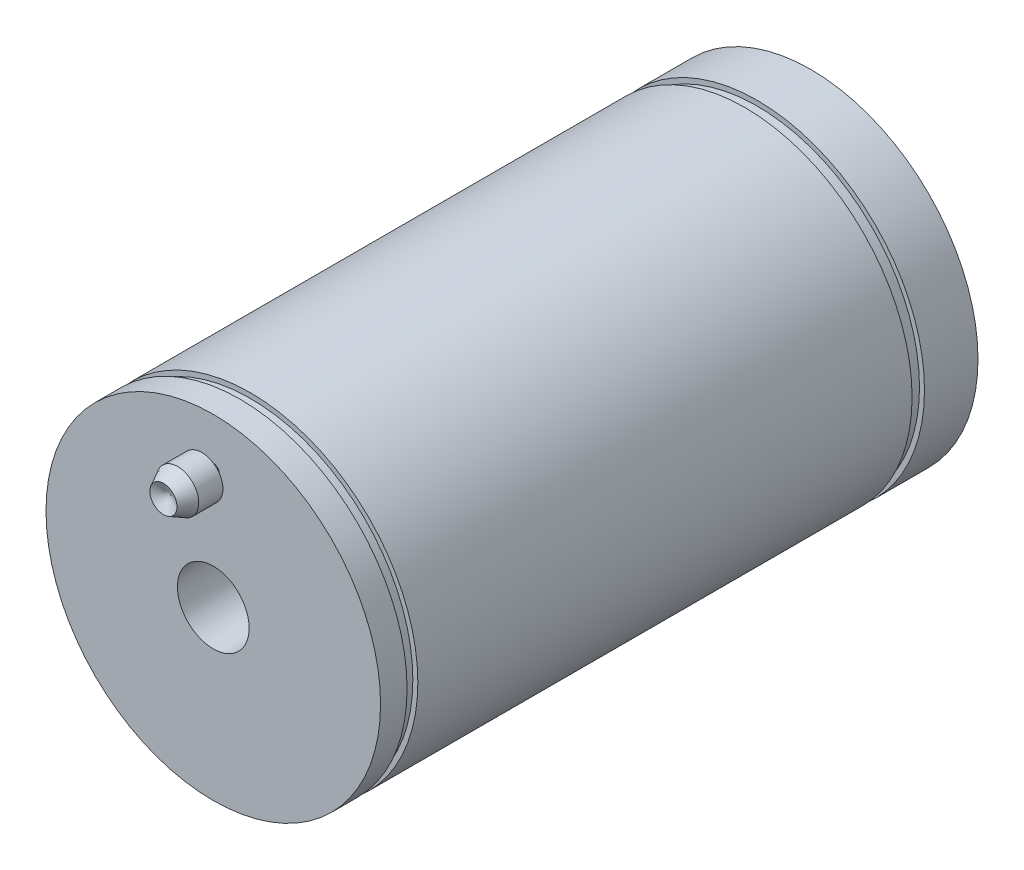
ISO-10303-21;
HEADER;
FILE_DESCRIPTION(('STEP AP214'),'2;1');
FILE_NAME('part.step','',(''),(''),'','','');
FILE_SCHEMA(('AUTOMOTIVE_DESIGN { 1 0 10303 214 1 1 1 1 }'));
ENDSEC;
DATA;
#1=APPLICATION_CONTEXT('core data for automotive mechanical design processes');
#2=APPLICATION_PROTOCOL_DEFINITION('international standard','automotive_design',2000,#1);
#3=PRODUCT_CONTEXT('',#1,'mechanical');
#4=PRODUCT('Part','Part','',(#3));
#5=PRODUCT_RELATED_PRODUCT_CATEGORY('part','',(#4));
#6=PRODUCT_DEFINITION_FORMATION('','',#4);
#7=PRODUCT_DEFINITION_CONTEXT('part definition',#1,'design');
#8=PRODUCT_DEFINITION('design','',#6,#7);
#9=PRODUCT_DEFINITION_SHAPE('','',#8);
#10=(LENGTH_UNIT() NAMED_UNIT(*) SI_UNIT(.MILLI.,.METRE.));
#11=(NAMED_UNIT(*) PLANE_ANGLE_UNIT() SI_UNIT($,.RADIAN.));
#12=(NAMED_UNIT(*) SI_UNIT($,.STERADIAN.) SOLID_ANGLE_UNIT());
#13=UNCERTAINTY_MEASURE_WITH_UNIT(LENGTH_MEASURE(1.E-05),#10,'distance_accuracy_value','');
#14=(GEOMETRIC_REPRESENTATION_CONTEXT(3) GLOBAL_UNCERTAINTY_ASSIGNED_CONTEXT((#13)) GLOBAL_UNIT_ASSIGNED_CONTEXT((#10,
#11,#12)) REPRESENTATION_CONTEXT('',''));
#15=CARTESIAN_POINT('',(0.,0.,0.));
#16=DIRECTION('',(0.,0.,1.));
#17=DIRECTION('',(1.,0.,0.));
#18=AXIS2_PLACEMENT_3D('',#15,#16,#17);
#19=CARTESIAN_POINT('',(0.,0.,-250.));
#20=DIRECTION('',(0.,0.,1.));
#21=DIRECTION('',(1.,0.,0.));
#22=AXIS2_PLACEMENT_3D('',#19,#20,#21);
#23=CYLINDRICAL_SURFACE('',#22,70.);
#24=CARTESIAN_POINT('',(0.,0.,0.));
#25=DIRECTION('',(0.,0.,1.));
#26=DIRECTION('',(1.,0.,0.));
#27=AXIS2_PLACEMENT_3D('',#24,#25,#26);
#28=CIRCLE('',#27,70.);
#29=CARTESIAN_POINT('',(70.,0.,0.));
#30=VERTEX_POINT('',#29);
#31=EDGE_CURVE('E44',#30,#30,#28,.T.);
#32=ORIENTED_EDGE('',*,*,#31,.F.);
#33=EDGE_LOOP('',(#32));
#34=FACE_BOUND('',#33,.T.);
#35=CARTESIAN_POINT('',(0.,0.,-11.0892700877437));
#36=DIRECTION('',(0.,0.,-1.));
#37=DIRECTION('',(-1.,0.,0.));
#38=AXIS2_PLACEMENT_3D('',#35,#36,#37);
#39=CIRCLE('',#38,70.);
#40=CARTESIAN_POINT('',(-70.,0.,-11.0892700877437));
#41=VERTEX_POINT('',#40);
#42=EDGE_CURVE('E90',#41,#41,#39,.F.);
#43=ORIENTED_EDGE('',*,*,#42,.T.);
#44=EDGE_LOOP('',(#43));
#45=FACE_BOUND('',#44,.T.);
#46=ADVANCED_FACE('F37',(#34,#45),#23,.T.);
#47=CARTESIAN_POINT('',(0.,0.,0.));
#48=DIRECTION('',(0.,0.,1.));
#49=DIRECTION('',(1.,0.,0.));
#50=AXIS2_PLACEMENT_3D('',#47,#48,#49);
#51=PLANE('',#50);
#52=CARTESIAN_POINT('',(0.,0.,0.));
#53=DIRECTION('',(0.,0.,1.));
#54=DIRECTION('',(1.,0.,0.));
#55=AXIS2_PLACEMENT_3D('',#52,#53,#54);
#56=CIRCLE('',#55,15.);
#57=CARTESIAN_POINT('',(15.,0.,0.));
#58=VERTEX_POINT('',#57);
#59=EDGE_CURVE('E59',#58,#58,#56,.T.);
#60=ORIENTED_EDGE('',*,*,#59,.F.);
#61=EDGE_LOOP('',(#60));
#62=FACE_BOUND('',#61,.T.);
#63=CARTESIAN_POINT('',(0.,49.7478647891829,0.));
#64=DIRECTION('',(0.,0.,1.));
#65=DIRECTION('',(1.,0.,0.));
#66=AXIS2_PLACEMENT_3D('',#63,#64,#65);
#67=CIRCLE('',#66,2.54698851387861);
#68=CARTESIAN_POINT('',(2.54698851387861,49.7478647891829,0.));
#69=VERTEX_POINT('',#68);
#70=EDGE_CURVE('E72',#69,#69,#67,.T.);
#71=ORIENTED_EDGE('',*,*,#70,.F.);
#72=EDGE_LOOP('',(#71));
#73=FACE_BOUND('',#72,.T.);
#74=ORIENTED_EDGE('',*,*,#31,.T.);
#75=EDGE_LOOP('',(#74));
#76=FACE_BOUND('',#75,.T.);
#77=ADVANCED_FACE('F106',(#62,#73,#76),#51,.T.);
#78=CARTESIAN_POINT('',(0.,71.4110782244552,-11.0892700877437));
#79=DIRECTION('',(0.,0.,-1.));
#80=DIRECTION('',(-1.,0.,0.));
#81=AXIS2_PLACEMENT_3D('',#78,#79,#80);
#82=PLANE('',#81);
#83=ORIENTED_EDGE('',*,*,#42,.F.);
#84=EDGE_LOOP('',(#83));
#85=FACE_BOUND('',#84,.T.);
#86=CARTESIAN_POINT('',(0.,0.,-11.0892700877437));
#87=DIRECTION('',(0.,0.,1.));
#88=DIRECTION('',(1.,0.,0.));
#89=AXIS2_PLACEMENT_3D('',#86,#87,#88);
#90=CIRCLE('',#89,67.9131744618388);
#91=CARTESIAN_POINT('',(67.9131744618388,0.,-11.0892700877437));
#92=VERTEX_POINT('',#91);
#93=EDGE_CURVE('E79',#92,#92,#90,.T.);
#94=ORIENTED_EDGE('',*,*,#93,.T.);
#95=EDGE_LOOP('',(#94));
#96=FACE_BOUND('',#95,.T.);
#97=ADVANCED_FACE('F102',(#85,#96),#82,.T.);
#98=CARTESIAN_POINT('',(0.,0.,46.5475958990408));
#99=DIRECTION('',(0.,0.,1.));
#100=DIRECTION('',(1.,0.,0.));
#101=AXIS2_PLACEMENT_3D('',#98,#99,#100);
#102=CYLINDRICAL_SURFACE('',#101,67.9131744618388);
#103=CARTESIAN_POINT('',(0.,0.,-15.5976793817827));
#104=DIRECTION('',(0.,0.,1.));
#105=DIRECTION('',(1.,0.,0.));
#106=AXIS2_PLACEMENT_3D('',#103,#104,#105);
#107=CIRCLE('',#106,67.9131744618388);
#108=CARTESIAN_POINT('',(67.9131744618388,0.,-15.5976793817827));
#109=VERTEX_POINT('',#108);
#110=EDGE_CURVE('E76',#109,#109,#107,.T.);
#111=ORIENTED_EDGE('',*,*,#110,.T.);
#112=EDGE_LOOP('',(#111));
#113=FACE_BOUND('',#112,.T.);
#114=ORIENTED_EDGE('',*,*,#93,.F.);
#115=EDGE_LOOP('',(#114));
#116=FACE_BOUND('',#115,.T.);
#117=ADVANCED_FACE('F105',(#113,#116),#102,.T.);
#118=CARTESIAN_POINT('',(0.,71.4110782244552,-15.5976793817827));
#119=DIRECTION('',(0.,0.,1.));
#120=DIRECTION('',(1.,0.,0.));
#121=AXIS2_PLACEMENT_3D('',#118,#119,#120);
#122=PLANE('',#121);
#123=CARTESIAN_POINT('',(0.,0.,-15.5976793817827));
#124=DIRECTION('',(0.,0.,1.));
#125=DIRECTION('',(1.,0.,0.));
#126=AXIS2_PLACEMENT_3D('',#123,#124,#125);
#127=CIRCLE('',#126,70.);
#128=CARTESIAN_POINT('',(70.,0.,-15.5976793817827));
#129=VERTEX_POINT('',#128);
#130=EDGE_CURVE('E96',#129,#129,#127,.F.);
#131=ORIENTED_EDGE('',*,*,#130,.F.);
#132=EDGE_LOOP('',(#131));
#133=FACE_BOUND('',#132,.T.);
#134=ORIENTED_EDGE('',*,*,#110,.F.);
#135=EDGE_LOOP('',(#134));
#136=FACE_BOUND('',#135,.T.);
#137=ADVANCED_FACE('F111',(#133,#136),#122,.T.);
#138=CARTESIAN_POINT('',(0.,0.,-222.422131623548));
#139=DIRECTION('',(0.,0.,-1.));
#140=DIRECTION('',(-1.,0.,0.));
#141=AXIS2_PLACEMENT_3D('',#138,#139,#140);
#142=CIRCLE('',#141,70.);
#143=CARTESIAN_POINT('',(-70.,0.,-222.422131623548));
#144=VERTEX_POINT('',#143);
#145=EDGE_CURVE('E93',#144,#144,#142,.F.);
#146=ORIENTED_EDGE('',*,*,#145,.T.);
#147=EDGE_LOOP('',(#146));
#148=FACE_BOUND('',#147,.T.);
#149=ORIENTED_EDGE('',*,*,#130,.T.);
#150=EDGE_LOOP('',(#149));
#151=FACE_BOUND('',#150,.T.);
#152=ADVANCED_FACE('F117',(#148,#151),#23,.T.);
#153=CARTESIAN_POINT('',(0.,71.4110782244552,-222.422131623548));
#154=DIRECTION('',(0.,0.,-1.));
#155=DIRECTION('',(-1.,0.,0.));
#156=AXIS2_PLACEMENT_3D('',#153,#154,#155);
#157=PLANE('',#156);
#158=ORIENTED_EDGE('',*,*,#145,.F.);
#159=EDGE_LOOP('',(#158));
#160=FACE_BOUND('',#159,.T.);
#161=CARTESIAN_POINT('',(0.,0.,-222.422131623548));
#162=DIRECTION('',(0.,0.,1.));
#163=DIRECTION('',(1.,0.,0.));
#164=AXIS2_PLACEMENT_3D('',#161,#162,#163);
#165=CIRCLE('',#164,67.9131744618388);
#166=CARTESIAN_POINT('',(67.9131744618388,0.,-222.422131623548));
#167=VERTEX_POINT('',#166);
#168=EDGE_CURVE('E80',#167,#167,#165,.T.);
#169=ORIENTED_EDGE('',*,*,#168,.T.);
#170=EDGE_LOOP('',(#169));
#171=FACE_BOUND('',#170,.T.);
#172=ADVANCED_FACE('F129',(#160,#171),#157,.T.);
#173=CARTESIAN_POINT('',(0.,0.,46.5475958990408));
#174=DIRECTION('',(0.,0.,1.));
#175=DIRECTION('',(1.,0.,0.));
#176=AXIS2_PLACEMENT_3D('',#173,#174,#175);
#177=CYLINDRICAL_SURFACE('',#176,67.9131744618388);
#178=CARTESIAN_POINT('',(0.,0.,-227.606276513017));
#179=DIRECTION('',(0.,0.,1.));
#180=DIRECTION('',(1.,0.,0.));
#181=AXIS2_PLACEMENT_3D('',#178,#179,#180);
#182=CIRCLE('',#181,67.9131744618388);
#183=CARTESIAN_POINT('',(67.9131744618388,0.,-227.606276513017));
#184=VERTEX_POINT('',#183);
#185=EDGE_CURVE('E75',#184,#184,#182,.T.);
#186=ORIENTED_EDGE('',*,*,#185,.T.);
#187=EDGE_LOOP('',(#186));
#188=FACE_BOUND('',#187,.T.);
#189=ORIENTED_EDGE('',*,*,#168,.F.);
#190=EDGE_LOOP('',(#189));
#191=FACE_BOUND('',#190,.T.);
#192=ADVANCED_FACE('F151',(#188,#191),#177,.T.);
#193=CARTESIAN_POINT('',(0.,71.4110782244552,-227.606276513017));
#194=DIRECTION('',(0.,0.,1.));
#195=DIRECTION('',(1.,0.,0.));
#196=AXIS2_PLACEMENT_3D('',#193,#194,#195);
#197=PLANE('',#196);
#198=CARTESIAN_POINT('',(0.,0.,-227.606276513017));
#199=DIRECTION('',(0.,0.,1.));
#200=DIRECTION('',(1.,0.,0.));
#201=AXIS2_PLACEMENT_3D('',#198,#199,#200);
#202=CIRCLE('',#201,70.);
#203=CARTESIAN_POINT('',(70.,0.,-227.606276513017));
#204=VERTEX_POINT('',#203);
#205=EDGE_CURVE('E83',#204,#204,#202,.F.);
#206=ORIENTED_EDGE('',*,*,#205,.F.);
#207=EDGE_LOOP('',(#206));
#208=FACE_BOUND('',#207,.T.);
#209=ORIENTED_EDGE('',*,*,#185,.F.);
#210=EDGE_LOOP('',(#209));
#211=FACE_BOUND('',#210,.T.);
#212=ADVANCED_FACE('F142',(#208,#211),#197,.T.);
#213=CARTESIAN_POINT('',(0.,0.,-250.));
#214=DIRECTION('',(0.,0.,1.));
#215=DIRECTION('',(1.,0.,0.));
#216=AXIS2_PLACEMENT_3D('',#213,#214,#215);
#217=PLANE('',#216);
#218=CARTESIAN_POINT('',(0.,0.,-250.));
#219=DIRECTION('',(0.,0.,1.));
#220=DIRECTION('',(1.,0.,0.));
#221=AXIS2_PLACEMENT_3D('',#218,#219,#220);
#222=CIRCLE('',#221,15.);
#223=CARTESIAN_POINT('',(15.,0.,-250.));
#224=VERTEX_POINT('',#223);
#225=EDGE_CURVE('E40',#224,#224,#222,.T.);
#226=ORIENTED_EDGE('',*,*,#225,.T.);
#227=EDGE_LOOP('',(#226));
#228=FACE_BOUND('',#227,.T.);
#229=CARTESIAN_POINT('',(0.,0.,-250.));
#230=DIRECTION('',(0.,0.,1.));
#231=DIRECTION('',(1.,0.,0.));
#232=AXIS2_PLACEMENT_3D('',#229,#230,#231);
#233=CIRCLE('',#232,70.);
#234=CARTESIAN_POINT('',(70.,0.,-250.));
#235=VERTEX_POINT('',#234);
#236=EDGE_CURVE('E11',#235,#235,#233,.T.);
#237=ORIENTED_EDGE('',*,*,#236,.F.);
#238=EDGE_LOOP('',(#237));
#239=FACE_BOUND('',#238,.T.);
#240=ADVANCED_FACE('F133',(#228,#239),#217,.F.);
#241=ORIENTED_EDGE('',*,*,#236,.T.);
#242=EDGE_LOOP('',(#241));
#243=FACE_BOUND('',#242,.T.);
#244=ORIENTED_EDGE('',*,*,#205,.T.);
#245=EDGE_LOOP('',(#244));
#246=FACE_BOUND('',#245,.T.);
#247=ADVANCED_FACE('F122',(#243,#246),#23,.T.);
#248=CARTESIAN_POINT('',(0.,49.7478647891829,17.8796704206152));
#249=DIRECTION('',(0.,0.,1.));
#250=DIRECTION('',(1.,0.,0.));
#251=AXIS2_PLACEMENT_3D('',#248,#249,#250);
#252=CYLINDRICAL_SURFACE('',#251,2.54698851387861);
#253=CARTESIAN_POINT('',(0.,49.7478647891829,4.76871004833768));
#254=DIRECTION('',(0.,0.,1.));
#255=DIRECTION('',(1.,0.,0.));
#256=AXIS2_PLACEMENT_3D('',#253,#254,#255);
#257=CIRCLE('',#256,2.54698851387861);
#258=CARTESIAN_POINT('',(2.54698851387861,49.7478647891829,4.76871004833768));
#259=VERTEX_POINT('',#258);
#260=EDGE_CURVE('E69',#259,#259,#257,.T.);
#261=ORIENTED_EDGE('',*,*,#260,.F.);
#262=EDGE_LOOP('',(#261));
#263=FACE_BOUND('',#262,.T.);
#264=ORIENTED_EDGE('',*,*,#70,.T.);
#265=EDGE_LOOP('',(#264));
#266=FACE_BOUND('',#265,.T.);
#267=ADVANCED_FACE('F132',(#263,#266),#252,.T.);
#268=CARTESIAN_POINT('',(0.,52.2948533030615,4.76871004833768));
#269=DIRECTION('',(0.,0.,1.));
#270=DIRECTION('',(1.,0.,0.));
#271=AXIS2_PLACEMENT_3D('',#268,#269,#270);
#272=PLANE('',#271);
#273=CARTESIAN_POINT('',(0.,49.7478647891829,4.76871004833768));
#274=DIRECTION('',(0.,0.,1.));
#275=DIRECTION('',(1.,0.,0.));
#276=AXIS2_PLACEMENT_3D('',#273,#274,#275);
#277=CIRCLE('',#276,8.80449232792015);
#278=CARTESIAN_POINT('',(8.80449232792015,49.7478647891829,4.76871004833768));
#279=VERTEX_POINT('',#278);
#280=EDGE_CURVE('E62',#279,#279,#277,.T.);
#281=ORIENTED_EDGE('',*,*,#280,.F.);
#282=EDGE_LOOP('',(#281));
#283=FACE_BOUND('',#282,.T.);
#284=ORIENTED_EDGE('',*,*,#260,.T.);
#285=EDGE_LOOP('',(#284));
#286=FACE_BOUND('',#285,.T.);
#287=ADVANCED_FACE('F139',(#283,#286),#272,.F.);
#288=CARTESIAN_POINT('',(0.,49.7478647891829,17.8796704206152));
#289=DIRECTION('',(0.,0.,1.));
#290=DIRECTION('',(1.,0.,0.));
#291=AXIS2_PLACEMENT_3D('',#288,#289,#290);
#292=CYLINDRICAL_SURFACE('',#291,8.80449232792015);
#293=CARTESIAN_POINT('',(0.,49.7478647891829,14.899906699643));
#294=DIRECTION('',(0.,0.,1.));
#295=DIRECTION('',(1.,0.,0.));
#296=AXIS2_PLACEMENT_3D('',#293,#294,#295);
#297=CIRCLE('',#296,8.80449232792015);
#298=CARTESIAN_POINT('',(8.80449232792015,49.7478647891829,14.899906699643));
#299=VERTEX_POINT('',#298);
#300=EDGE_CURVE('E58',#299,#299,#297,.T.);
#301=ORIENTED_EDGE('',*,*,#300,.F.);
#302=EDGE_LOOP('',(#301));
#303=FACE_BOUND('',#302,.T.);
#304=ORIENTED_EDGE('',*,*,#280,.T.);
#305=EDGE_LOOP('',(#304));
#306=FACE_BOUND('',#305,.T.);
#307=ADVANCED_FACE('F260',(#303,#306),#292,.T.);
#308=CARTESIAN_POINT('',(0.,49.7478647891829,14.899906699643));
#309=DIRECTION('',(0.,0.,-1.));
#310=DIRECTION('',(-1.,0.,0.));
#311=AXIS2_PLACEMENT_3D('',#308,#309,#310);
#312=CONICAL_SURFACE('',#311,8.80449232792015,0.483447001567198);
#313=CARTESIAN_POINT('',(0.,49.7478647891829,20.8594341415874));
#314=DIRECTION('',(0.,0.,1.));
#315=DIRECTION('',(1.,0.,0.));
#316=AXIS2_PLACEMENT_3D('',#313,#314,#315);
#317=CIRCLE('',#316,5.67574042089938);
#318=CARTESIAN_POINT('',(5.67574042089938,49.7478647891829,20.8594341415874));
#319=VERTEX_POINT('',#318);
#320=EDGE_CURVE('E56',#319,#319,#317,.T.);
#321=ORIENTED_EDGE('',*,*,#320,.F.);
#322=EDGE_LOOP('',(#321));
#323=FACE_BOUND('',#322,.T.);
#324=ORIENTED_EDGE('',*,*,#300,.T.);
#325=EDGE_LOOP('',(#324));
#326=FACE_BOUND('',#325,.T.);
#327=ADVANCED_FACE('F52',(#323,#326),#312,.T.);
#328=CARTESIAN_POINT('',(0.,49.7478647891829,20.8594341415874));
#329=DIRECTION('',(0.,0.,1.));
#330=DIRECTION('',(1.,0.,0.));
#331=AXIS2_PLACEMENT_3D('',#328,#329,#330);
#332=CONICAL_SURFACE('',#331,5.67574042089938,1.0873493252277);
#333=CARTESIAN_POINT('',(0.,49.7478647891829,17.8796704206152));
#334=VERTEX_POINT('',#333);
#335=VERTEX_LOOP('',#334);
#336=FACE_BOUND('',#335,.T.);
#337=ORIENTED_EDGE('',*,*,#320,.T.);
#338=EDGE_LOOP('',(#337));
#339=FACE_BOUND('',#338,.T.);
#340=ADVANCED_FACE('F48',(#336,#339),#332,.F.);
#341=CARTESIAN_POINT('',(0.,0.,-265.));
#342=DIRECTION('',(0.,0.,1.));
#343=DIRECTION('',(1.,0.,0.));
#344=AXIS2_PLACEMENT_3D('',#341,#342,#343);
#345=CYLINDRICAL_SURFACE('',#344,15.);
#346=ORIENTED_EDGE('',*,*,#59,.T.);
#347=EDGE_LOOP('',(#346));
#348=FACE_BOUND('',#347,.T.);
#349=ORIENTED_EDGE('',*,*,#225,.F.);
#350=EDGE_LOOP('',(#349));
#351=FACE_BOUND('',#350,.T.);
#352=ADVANCED_FACE('F51',(#348,#351),#345,.F.);
#353=CLOSED_SHELL('',(#46,#77,#97,#117,#137,#152,#172,#192,#212,#240,#247,#267,#287,#307,#327,
#340,#352));
#354=MANIFOLD_SOLID_BREP('B2',#353);
#355=ADVANCED_BREP_SHAPE_REPRESENTATION('',(#18,#354),#14);
#356=SHAPE_DEFINITION_REPRESENTATION(#9,#355);
ENDSEC;
END-ISO-10303-21;
